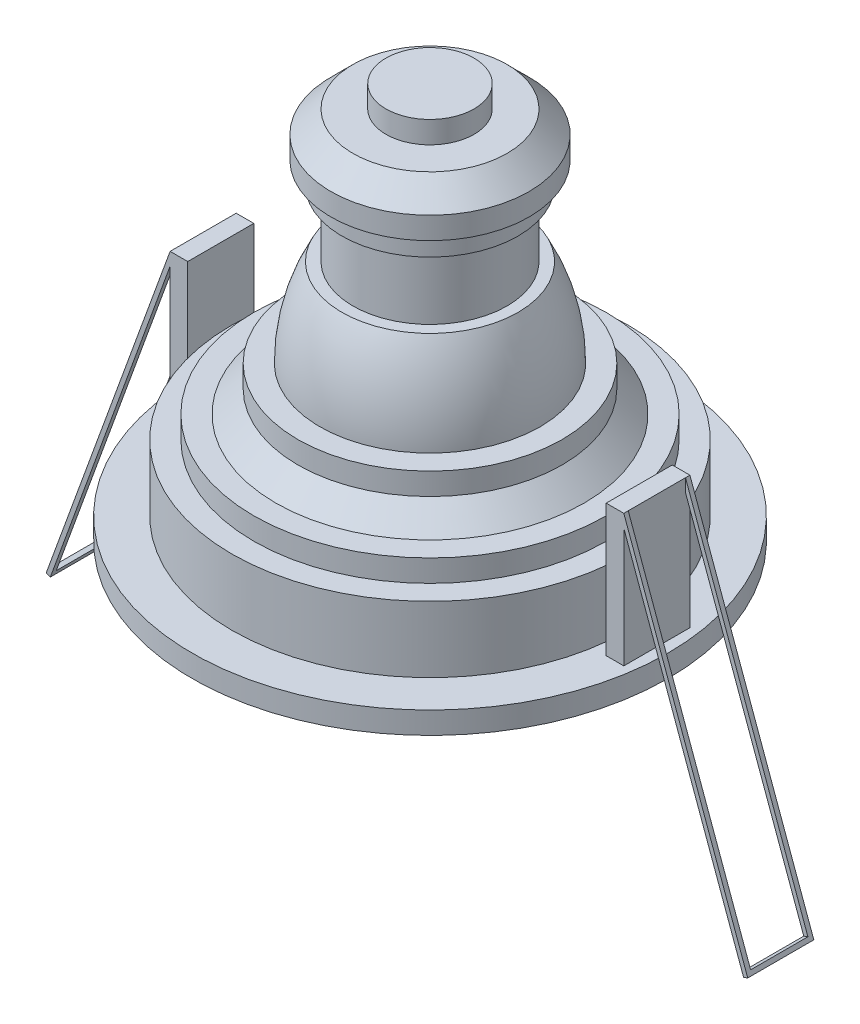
ISO-10303-21;
HEADER;
FILE_DESCRIPTION(('STEP AP214'),'2;1');
FILE_NAME('part.step','',(''),(''),'','','');
FILE_SCHEMA(('AUTOMOTIVE_DESIGN { 1 0 10303 214 1 1 1 1 }'));
ENDSEC;
DATA;
#1=APPLICATION_CONTEXT('core data for automotive mechanical design processes');
#2=APPLICATION_PROTOCOL_DEFINITION('international standard','automotive_design',2000,#1);
#3=PRODUCT_CONTEXT('',#1,'mechanical');
#4=PRODUCT('Part','Part','',(#3));
#5=PRODUCT_RELATED_PRODUCT_CATEGORY('part','',(#4));
#6=PRODUCT_DEFINITION_FORMATION('','',#4);
#7=PRODUCT_DEFINITION_CONTEXT('part definition',#1,'design');
#8=PRODUCT_DEFINITION('design','',#6,#7);
#9=PRODUCT_DEFINITION_SHAPE('','',#8);
#10=(LENGTH_UNIT() NAMED_UNIT(*) SI_UNIT(.MILLI.,.METRE.));
#11=(NAMED_UNIT(*) PLANE_ANGLE_UNIT() SI_UNIT($,.RADIAN.));
#12=(NAMED_UNIT(*) SI_UNIT($,.STERADIAN.) SOLID_ANGLE_UNIT());
#13=UNCERTAINTY_MEASURE_WITH_UNIT(LENGTH_MEASURE(1.E-05),#10,'distance_accuracy_value','');
#14=(GEOMETRIC_REPRESENTATION_CONTEXT(3) GLOBAL_UNCERTAINTY_ASSIGNED_CONTEXT((#13)) GLOBAL_UNIT_ASSIGNED_CONTEXT((#10,
#11,#12)) REPRESENTATION_CONTEXT('',''));
#15=CARTESIAN_POINT('',(0.,0.,0.));
#16=DIRECTION('',(0.,0.,1.));
#17=DIRECTION('',(1.,0.,0.));
#18=AXIS2_PLACEMENT_3D('',#15,#16,#17);
#19=CARTESIAN_POINT('',(51.5,35.,7.5));
#20=DIRECTION('',(1.,0.,0.));
#21=DIRECTION('',(0.,1.,0.));
#22=AXIS2_PLACEMENT_3D('',#19,#20,#21);
#23=PLANE('',#22);
#24=DIRECTION('',(0.,0.,1.));
#25=VECTOR('',#24,1.);
#26=CARTESIAN_POINT('',(51.5,35.,7.5));
#27=LINE('',#26,#25);
#28=CARTESIAN_POINT('',(51.5,35.,-6.5));
#29=VERTEX_POINT('',#28);
#30=CARTESIAN_POINT('',(51.5,35.,6.5));
#31=VERTEX_POINT('',#30);
#32=EDGE_CURVE('E282',#29,#31,#27,.T.);
#33=ORIENTED_EDGE('',*,*,#32,.T.);
#34=DIRECTION('',(0.,-1.,0.));
#35=VECTOR('',#34,1.);
#36=CARTESIAN_POINT('',(51.5,35.,6.5));
#37=LINE('',#36,#35);
#38=CARTESIAN_POINT('',(51.5,32.0761955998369,6.5));
#39=VERTEX_POINT('',#38);
#40=EDGE_CURVE('E59',#31,#39,#37,.T.);
#41=ORIENTED_EDGE('',*,*,#40,.T.);
#42=DIRECTION('',(0.,0.,-1.));
#43=VECTOR('',#42,1.);
#44=CARTESIAN_POINT('',(51.5,32.0761955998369,7.5));
#45=LINE('',#44,#43);
#46=CARTESIAN_POINT('',(51.5,32.0761955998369,7.5));
#47=VERTEX_POINT('',#46);
#48=EDGE_CURVE('E272',#47,#39,#45,.T.);
#49=ORIENTED_EDGE('',*,*,#48,.F.);
#50=DIRECTION('',(0.,-1.,0.));
#51=VECTOR('',#50,1.);
#52=CARTESIAN_POINT('',(51.5,35.,7.5));
#53=LINE('',#52,#51);
#54=CARTESIAN_POINT('',(51.5,5.00000000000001,7.5));
#55=VERTEX_POINT('',#54);
#56=EDGE_CURVE('E311',#47,#55,#53,.T.);
#57=ORIENTED_EDGE('',*,*,#56,.T.);
#58=DIRECTION('',(0.,0.,1.));
#59=VECTOR('',#58,1.);
#60=CARTESIAN_POINT('',(51.5,5.,7.5));
#61=LINE('',#60,#59);
#62=CARTESIAN_POINT('',(51.5,5.00000000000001,-7.5));
#63=VERTEX_POINT('',#62);
#64=EDGE_CURVE('E298',#63,#55,#61,.T.);
#65=ORIENTED_EDGE('',*,*,#64,.F.);
#66=DIRECTION('',(0.,-1.,0.));
#67=VECTOR('',#66,1.);
#68=CARTESIAN_POINT('',(51.5,35.,-7.5));
#69=LINE('',#68,#67);
#70=CARTESIAN_POINT('',(51.5,32.0761955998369,-7.5));
#71=VERTEX_POINT('',#70);
#72=EDGE_CURVE('E308',#71,#63,#69,.T.);
#73=ORIENTED_EDGE('',*,*,#72,.F.);
#74=CARTESIAN_POINT('',(51.5,32.0761955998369,-6.5));
#75=VERTEX_POINT('',#74);
#76=EDGE_CURVE('E66',#75,#71,#45,.T.);
#77=ORIENTED_EDGE('',*,*,#76,.F.);
#78=DIRECTION('',(0.,1.,0.));
#79=VECTOR('',#78,1.);
#80=CARTESIAN_POINT('',(51.5,35.,-6.5));
#81=LINE('',#80,#79);
#82=EDGE_CURVE('E220',#75,#29,#81,.T.);
#83=ORIENTED_EDGE('',*,*,#82,.T.);
#84=EDGE_LOOP('',(#33,#41,#49,#57,#65,#73,#77,#83));
#85=FACE_BOUND('',#84,.T.);
#86=ADVANCED_FACE('F43',(#85),#23,.T.);
#87=CARTESIAN_POINT('',(0.,5.,0.));
#88=DIRECTION('',(0.,1.,0.));
#89=DIRECTION('',(-1.,0.,0.));
#90=AXIS2_PLACEMENT_3D('',#87,#88,#89);
#91=PLANE('',#90);
#92=DIRECTION('',(0.,0.,-1.));
#93=VECTOR('',#92,1.);
#94=CARTESIAN_POINT('',(47.5,5.,-7.5));
#95=LINE('',#94,#93);
#96=CARTESIAN_POINT('',(47.5,5.00000000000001,7.5));
#97=VERTEX_POINT('',#96);
#98=CARTESIAN_POINT('',(47.5,5.,-7.5));
#99=VERTEX_POINT('',#98);
#100=EDGE_CURVE('E292',#97,#99,#95,.T.);
#101=ORIENTED_EDGE('',*,*,#100,.T.);
#102=DIRECTION('',(1.,0.,0.));
#103=VECTOR('',#102,1.);
#104=CARTESIAN_POINT('',(51.5,5.,-7.5));
#105=LINE('',#104,#103);
#106=EDGE_CURVE('E278',#99,#63,#105,.T.);
#107=ORIENTED_EDGE('',*,*,#106,.T.);
#108=ORIENTED_EDGE('',*,*,#64,.T.);
#109=DIRECTION('',(-1.,0.,0.));
#110=VECTOR('',#109,1.);
#111=CARTESIAN_POINT('',(47.5,5.,7.5));
#112=LINE('',#111,#110);
#113=EDGE_CURVE('E295',#55,#97,#112,.T.);
#114=ORIENTED_EDGE('',*,*,#113,.T.);
#115=EDGE_LOOP('',(#101,#107,#108,#114));
#116=FACE_BOUND('',#115,.T.);
#117=CARTESIAN_POINT('',(0.,5.,0.));
#118=DIRECTION('',(0.,-1.,0.));
#119=DIRECTION('',(1.,0.,0.));
#120=AXIS2_PLACEMENT_3D('',#117,#118,#119);
#121=CIRCLE('',#120,45.);
#122=CARTESIAN_POINT('',(45.,5.00000000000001,0.));
#123=VERTEX_POINT('',#122);
#124=EDGE_CURVE('E443',#123,#123,#121,.T.);
#125=ORIENTED_EDGE('',*,*,#124,.T.);
#126=EDGE_LOOP('',(#125));
#127=FACE_BOUND('',#126,.T.);
#128=CARTESIAN_POINT('',(0.,5.,0.));
#129=DIRECTION('',(0.,-1.,0.));
#130=DIRECTION('',(1.,0.,0.));
#131=AXIS2_PLACEMENT_3D('',#128,#129,#130);
#132=CIRCLE('',#131,54.);
#133=CARTESIAN_POINT('',(54.,5.00000000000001,0.));
#134=VERTEX_POINT('',#133);
#135=EDGE_CURVE('E439',#134,#134,#132,.T.);
#136=ORIENTED_EDGE('',*,*,#135,.F.);
#137=EDGE_LOOP('',(#136));
#138=FACE_BOUND('',#137,.T.);
#139=DIRECTION('',(-1.,0.,0.));
#140=VECTOR('',#139,1.);
#141=CARTESIAN_POINT('',(-51.5,5.,-7.5));
#142=LINE('',#141,#140);
#143=CARTESIAN_POINT('',(-47.5,5.,-7.5));
#144=VERTEX_POINT('',#143);
#145=CARTESIAN_POINT('',(-51.5,5.,-7.5));
#146=VERTEX_POINT('',#145);
#147=EDGE_CURVE('E413',#144,#146,#142,.T.);
#148=ORIENTED_EDGE('',*,*,#147,.F.);
#149=DIRECTION('',(0.,0.,-1.));
#150=VECTOR('',#149,1.);
#151=CARTESIAN_POINT('',(-47.5,5.,-7.5));
#152=LINE('',#151,#150);
#153=CARTESIAN_POINT('',(-47.5,5.,7.5));
#154=VERTEX_POINT('',#153);
#155=EDGE_CURVE('E409',#154,#144,#152,.T.);
#156=ORIENTED_EDGE('',*,*,#155,.F.);
#157=DIRECTION('',(1.,0.,0.));
#158=VECTOR('',#157,1.);
#159=CARTESIAN_POINT('',(-47.5,5.,7.5));
#160=LINE('',#159,#158);
#161=CARTESIAN_POINT('',(-51.5,5.,7.5));
#162=VERTEX_POINT('',#161);
#163=EDGE_CURVE('E396',#162,#154,#160,.T.);
#164=ORIENTED_EDGE('',*,*,#163,.F.);
#165=DIRECTION('',(0.,0.,1.));
#166=VECTOR('',#165,1.);
#167=CARTESIAN_POINT('',(-51.5,5.,7.5));
#168=LINE('',#167,#166);
#169=EDGE_CURVE('E417',#146,#162,#168,.T.);
#170=ORIENTED_EDGE('',*,*,#169,.F.);
#171=EDGE_LOOP('',(#148,#156,#164,#170));
#172=FACE_BOUND('',#171,.T.);
#173=ADVANCED_FACE('F526',(#116,#127,#138,#172),#91,.T.);
#174=CARTESIAN_POINT('',(0.,0.,0.));
#175=DIRECTION('',(0.,-1.,0.));
#176=DIRECTION('',(1.,0.,0.));
#177=AXIS2_PLACEMENT_3D('',#174,#175,#176);
#178=PLANE('',#177);
#179=CARTESIAN_POINT('',(0.,0.,0.));
#180=DIRECTION('',(0.,-1.,0.));
#181=DIRECTION('',(1.,0.,0.));
#182=AXIS2_PLACEMENT_3D('',#179,#180,#181);
#183=CIRCLE('',#182,54.);
#184=CARTESIAN_POINT('',(54.,0.,0.));
#185=VERTEX_POINT('',#184);
#186=EDGE_CURVE('E435',#185,#185,#183,.T.);
#187=ORIENTED_EDGE('',*,*,#186,.T.);
#188=EDGE_LOOP('',(#187));
#189=FACE_BOUND('',#188,.T.);
#190=CARTESIAN_POINT('',(0.,0.,0.));
#191=DIRECTION('',(0.,-1.,0.));
#192=DIRECTION('',(1.,0.,0.));
#193=AXIS2_PLACEMENT_3D('',#190,#191,#192);
#194=CIRCLE('',#193,39.);
#195=CARTESIAN_POINT('',(39.,0.,0.));
#196=VERTEX_POINT('',#195);
#197=EDGE_CURVE('E11',#196,#196,#194,.T.);
#198=ORIENTED_EDGE('',*,*,#197,.F.);
#199=EDGE_LOOP('',(#198));
#200=FACE_BOUND('',#199,.T.);
#201=ADVANCED_FACE('F45',(#189,#200),#178,.T.);
#202=CARTESIAN_POINT('',(0.,19.974985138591,0.));
#203=DIRECTION('',(0.,-1.,0.));
#204=DIRECTION('',(1.,0.,0.));
#205=AXIS2_PLACEMENT_3D('',#202,#203,#204);
#206=TOROIDAL_SURFACE('',#205,39.9999843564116,20.);
#207=CARTESIAN_POINT('',(0.,20.,0.));
#208=DIRECTION('',(0.,-1.,0.));
#209=DIRECTION('',(1.,0.,0.));
#210=AXIS2_PLACEMENT_3D('',#207,#208,#209);
#211=CIRCLE('',#210,20.);
#212=CARTESIAN_POINT('',(20.,20.,0.));
#213=VERTEX_POINT('',#212);
#214=EDGE_CURVE('E52',#213,#213,#211,.T.);
#215=ORIENTED_EDGE('',*,*,#214,.F.);
#216=EDGE_LOOP('',(#215));
#217=FACE_BOUND('',#216,.T.);
#218=ORIENTED_EDGE('',*,*,#197,.T.);
#219=EDGE_LOOP('',(#218));
#220=FACE_BOUND('',#219,.T.);
#221=ADVANCED_FACE('F520',(#217,#220),#206,.T.);
#222=CARTESIAN_POINT('',(0.,20.,0.));
#223=DIRECTION('',(0.,-1.,0.));
#224=DIRECTION('',(1.,0.,0.));
#225=AXIS2_PLACEMENT_3D('',#222,#223,#224);
#226=PLANE('',#225);
#227=ORIENTED_EDGE('',*,*,#214,.T.);
#228=EDGE_LOOP('',(#227));
#229=FACE_BOUND('',#228,.T.);
#230=ADVANCED_FACE('F518',(#229),#226,.T.);
#231=CARTESIAN_POINT('',(0.,90.,0.));
#232=DIRECTION('',(0.,-1.,0.));
#233=DIRECTION('',(1.,0.,0.));
#234=AXIS2_PLACEMENT_3D('',#231,#232,#233);
#235=PLANE('',#234);
#236=CARTESIAN_POINT('',(0.,90.,0.));
#237=DIRECTION('',(0.,-1.,0.));
#238=DIRECTION('',(1.,0.,0.));
#239=AXIS2_PLACEMENT_3D('',#236,#237,#238);
#240=CIRCLE('',#239,10.);
#241=CARTESIAN_POINT('',(10.,90.,0.));
#242=VERTEX_POINT('',#241);
#243=EDGE_CURVE('E511',#242,#242,#240,.T.);
#244=ORIENTED_EDGE('',*,*,#243,.F.);
#245=EDGE_LOOP('',(#244));
#246=FACE_BOUND('',#245,.T.);
#247=ADVANCED_FACE('F664',(#246),#235,.F.);
#248=CARTESIAN_POINT('',(0.,20.,0.));
#249=DIRECTION('',(0.,-1.,0.));
#250=DIRECTION('',(1.,0.,0.));
#251=AXIS2_PLACEMENT_3D('',#248,#249,#250);
#252=CYLINDRICAL_SURFACE('',#251,10.);
#253=CARTESIAN_POINT('',(0.,85.,0.));
#254=DIRECTION('',(0.,-1.,0.));
#255=DIRECTION('',(1.,0.,0.));
#256=AXIS2_PLACEMENT_3D('',#253,#254,#255);
#257=CIRCLE('',#256,10.);
#258=CARTESIAN_POINT('',(10.,85.,0.));
#259=VERTEX_POINT('',#258);
#260=EDGE_CURVE('E507',#259,#259,#257,.T.);
#261=ORIENTED_EDGE('',*,*,#260,.F.);
#262=EDGE_LOOP('',(#261));
#263=FACE_BOUND('',#262,.T.);
#264=ORIENTED_EDGE('',*,*,#243,.T.);
#265=EDGE_LOOP('',(#264));
#266=FACE_BOUND('',#265,.T.);
#267=ADVANCED_FACE('F660',(#263,#266),#252,.T.);
#268=CARTESIAN_POINT('',(0.,85.,0.));
#269=DIRECTION('',(0.,-1.,0.));
#270=DIRECTION('',(1.,0.,0.));
#271=AXIS2_PLACEMENT_3D('',#268,#269,#270);
#272=PLANE('',#271);
#273=CARTESIAN_POINT('',(0.,85.,0.));
#274=DIRECTION('',(0.,-1.,0.));
#275=DIRECTION('',(1.,0.,0.));
#276=AXIS2_PLACEMENT_3D('',#273,#274,#275);
#277=CIRCLE('',#276,17.5);
#278=CARTESIAN_POINT('',(17.5,85.,0.));
#279=VERTEX_POINT('',#278);
#280=EDGE_CURVE('E503',#279,#279,#277,.T.);
#281=ORIENTED_EDGE('',*,*,#280,.F.);
#282=EDGE_LOOP('',(#281));
#283=FACE_BOUND('',#282,.T.);
#284=ORIENTED_EDGE('',*,*,#260,.T.);
#285=EDGE_LOOP('',(#284));
#286=FACE_BOUND('',#285,.T.);
#287=ADVANCED_FACE('F656',(#283,#286),#272,.F.);
#288=CARTESIAN_POINT('',(0.,85.,0.));
#289=DIRECTION('',(0.,-1.,0.));
#290=DIRECTION('',(1.,0.,0.));
#291=AXIS2_PLACEMENT_3D('',#288,#289,#290);
#292=CONICAL_SURFACE('',#291,17.5,0.785398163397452);
#293=CARTESIAN_POINT('',(0.,80.,0.));
#294=DIRECTION('',(0.,-1.,0.));
#295=DIRECTION('',(1.,0.,0.));
#296=AXIS2_PLACEMENT_3D('',#293,#294,#295);
#297=CIRCLE('',#296,22.5);
#298=CARTESIAN_POINT('',(22.5,80.,0.));
#299=VERTEX_POINT('',#298);
#300=EDGE_CURVE('E499',#299,#299,#297,.T.);
#301=ORIENTED_EDGE('',*,*,#300,.F.);
#302=EDGE_LOOP('',(#301));
#303=FACE_BOUND('',#302,.T.);
#304=ORIENTED_EDGE('',*,*,#280,.T.);
#305=EDGE_LOOP('',(#304));
#306=FACE_BOUND('',#305,.T.);
#307=ADVANCED_FACE('F652',(#303,#306),#292,.T.);
#308=CARTESIAN_POINT('',(0.,20.,0.));
#309=DIRECTION('',(0.,-1.,0.));
#310=DIRECTION('',(1.,0.,0.));
#311=AXIS2_PLACEMENT_3D('',#308,#309,#310);
#312=CYLINDRICAL_SURFACE('',#311,22.5);
#313=ORIENTED_EDGE('',*,*,#300,.T.);
#314=EDGE_LOOP('',(#313));
#315=FACE_BOUND('',#314,.T.);
#316=CARTESIAN_POINT('',(0.,75.,0.));
#317=DIRECTION('',(0.,-1.,0.));
#318=DIRECTION('',(1.,0.,0.));
#319=AXIS2_PLACEMENT_3D('',#316,#317,#318);
#320=CIRCLE('',#319,22.5);
#321=CARTESIAN_POINT('',(22.5,75.,0.));
#322=VERTEX_POINT('',#321);
#323=EDGE_CURVE('E495',#322,#322,#320,.T.);
#324=ORIENTED_EDGE('',*,*,#323,.F.);
#325=EDGE_LOOP('',(#324));
#326=FACE_BOUND('',#325,.T.);
#327=ADVANCED_FACE('F648',(#315,#326),#312,.T.);
#328=CARTESIAN_POINT('',(0.,75.,0.));
#329=DIRECTION('',(0.,-1.,0.));
#330=DIRECTION('',(1.,0.,0.));
#331=AXIS2_PLACEMENT_3D('',#328,#329,#330);
#332=PLANE('',#331);
#333=ORIENTED_EDGE('',*,*,#323,.T.);
#334=EDGE_LOOP('',(#333));
#335=FACE_BOUND('',#334,.T.);
#336=CARTESIAN_POINT('',(0.,75.,0.));
#337=DIRECTION('',(0.,-1.,0.));
#338=DIRECTION('',(1.,0.,0.));
#339=AXIS2_PLACEMENT_3D('',#336,#337,#338);
#340=CIRCLE('',#339,20.);
#341=CARTESIAN_POINT('',(20.,75.,0.));
#342=VERTEX_POINT('',#341);
#343=EDGE_CURVE('E491',#342,#342,#340,.T.);
#344=ORIENTED_EDGE('',*,*,#343,.F.);
#345=EDGE_LOOP('',(#344));
#346=FACE_BOUND('',#345,.T.);
#347=ADVANCED_FACE('F644',(#335,#346),#332,.T.);
#348=CARTESIAN_POINT('',(0.,20.,0.));
#349=DIRECTION('',(0.,-1.,0.));
#350=DIRECTION('',(1.,0.,0.));
#351=AXIS2_PLACEMENT_3D('',#348,#349,#350);
#352=CYLINDRICAL_SURFACE('',#351,20.);
#353=ORIENTED_EDGE('',*,*,#343,.T.);
#354=EDGE_LOOP('',(#353));
#355=FACE_BOUND('',#354,.T.);
#356=CARTESIAN_POINT('',(0.,70.,0.));
#357=DIRECTION('',(0.,-1.,0.));
#358=DIRECTION('',(1.,0.,0.));
#359=AXIS2_PLACEMENT_3D('',#356,#357,#358);
#360=CIRCLE('',#359,20.);
#361=CARTESIAN_POINT('',(20.,70.,0.));
#362=VERTEX_POINT('',#361);
#363=EDGE_CURVE('E487',#362,#362,#360,.T.);
#364=ORIENTED_EDGE('',*,*,#363,.F.);
#365=EDGE_LOOP('',(#364));
#366=FACE_BOUND('',#365,.T.);
#367=ADVANCED_FACE('F640',(#355,#366),#352,.T.);
#368=CARTESIAN_POINT('',(0.,70.,0.));
#369=DIRECTION('',(0.,-1.,0.));
#370=DIRECTION('',(1.,0.,0.));
#371=AXIS2_PLACEMENT_3D('',#368,#369,#370);
#372=PLANE('',#371);
#373=ORIENTED_EDGE('',*,*,#363,.T.);
#374=EDGE_LOOP('',(#373));
#375=FACE_BOUND('',#374,.T.);
#376=CARTESIAN_POINT('',(0.,70.,0.));
#377=DIRECTION('',(0.,-1.,0.));
#378=DIRECTION('',(1.,0.,0.));
#379=AXIS2_PLACEMENT_3D('',#376,#377,#378);
#380=CIRCLE('',#379,17.5);
#381=CARTESIAN_POINT('',(17.5,70.,0.));
#382=VERTEX_POINT('',#381);
#383=EDGE_CURVE('E483',#382,#382,#380,.T.);
#384=ORIENTED_EDGE('',*,*,#383,.F.);
#385=EDGE_LOOP('',(#384));
#386=FACE_BOUND('',#385,.T.);
#387=ADVANCED_FACE('F636',(#375,#386),#372,.T.);
#388=CARTESIAN_POINT('',(0.,20.,0.));
#389=DIRECTION('',(0.,-1.,0.));
#390=DIRECTION('',(1.,0.,0.));
#391=AXIS2_PLACEMENT_3D('',#388,#389,#390);
#392=CYLINDRICAL_SURFACE('',#391,17.5);
#393=ORIENTED_EDGE('',*,*,#383,.T.);
#394=EDGE_LOOP('',(#393));
#395=FACE_BOUND('',#394,.T.);
#396=CARTESIAN_POINT('',(0.,55.,0.));
#397=DIRECTION('',(0.,-1.,0.));
#398=DIRECTION('',(1.,0.,0.));
#399=AXIS2_PLACEMENT_3D('',#396,#397,#398);
#400=CIRCLE('',#399,17.5);
#401=CARTESIAN_POINT('',(17.5,55.,0.));
#402=VERTEX_POINT('',#401);
#403=EDGE_CURVE('E479',#402,#402,#400,.T.);
#404=ORIENTED_EDGE('',*,*,#403,.F.);
#405=EDGE_LOOP('',(#404));
#406=FACE_BOUND('',#405,.T.);
#407=ADVANCED_FACE('F632',(#395,#406),#392,.T.);
#408=CARTESIAN_POINT('',(0.,55.,0.));
#409=DIRECTION('',(0.,1.,0.));
#410=DIRECTION('',(-1.,0.,0.));
#411=AXIS2_PLACEMENT_3D('',#408,#409,#410);
#412=PLANE('',#411);
#413=ORIENTED_EDGE('',*,*,#403,.T.);
#414=EDGE_LOOP('',(#413));
#415=FACE_BOUND('',#414,.T.);
#416=CARTESIAN_POINT('',(0.,55.,0.));
#417=DIRECTION('',(0.,-1.,0.));
#418=DIRECTION('',(1.,0.,0.));
#419=AXIS2_PLACEMENT_3D('',#416,#417,#418);
#420=CIRCLE('',#419,20.);
#421=CARTESIAN_POINT('',(20.,55.,0.));
#422=VERTEX_POINT('',#421);
#423=EDGE_CURVE('E475',#422,#422,#420,.T.);
#424=ORIENTED_EDGE('',*,*,#423,.F.);
#425=EDGE_LOOP('',(#424));
#426=FACE_BOUND('',#425,.T.);
#427=ADVANCED_FACE('F628',(#415,#426),#412,.T.);
#428=CARTESIAN_POINT('',(0.,35.,0.));
#429=DIRECTION('',(0.,-1.,0.));
#430=DIRECTION('',(1.,0.,0.));
#431=AXIS2_PLACEMENT_3D('',#428,#429,#430);
#432=DEGENERATE_TOROIDAL_SURFACE('',#431,17.5000000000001,42.5000000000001,.F.);
#433=CARTESIAN_POINT('',(0.,35.,0.));
#434=DIRECTION('',(0.,-1.,0.));
#435=DIRECTION('',(1.,0.,0.));
#436=AXIS2_PLACEMENT_3D('',#433,#434,#435);
#437=CIRCLE('',#436,25.);
#438=CARTESIAN_POINT('',(25.,35.,0.));
#439=VERTEX_POINT('',#438);
#440=EDGE_CURVE('E471',#439,#439,#437,.T.);
#441=ORIENTED_EDGE('',*,*,#440,.F.);
#442=EDGE_LOOP('',(#441));
#443=FACE_BOUND('',#442,.T.);
#444=ORIENTED_EDGE('',*,*,#423,.T.);
#445=EDGE_LOOP('',(#444));
#446=FACE_BOUND('',#445,.T.);
#447=ADVANCED_FACE('F624',(#443,#446),#432,.F.);
#448=CARTESIAN_POINT('',(0.,35.,0.));
#449=DIRECTION('',(0.,1.,0.));
#450=DIRECTION('',(-1.,0.,0.));
#451=AXIS2_PLACEMENT_3D('',#448,#449,#450);
#452=PLANE('',#451);
#453=ORIENTED_EDGE('',*,*,#440,.T.);
#454=EDGE_LOOP('',(#453));
#455=FACE_BOUND('',#454,.T.);
#456=CARTESIAN_POINT('',(0.,35.,0.));
#457=DIRECTION('',(0.,-1.,0.));
#458=DIRECTION('',(1.,0.,0.));
#459=AXIS2_PLACEMENT_3D('',#456,#457,#458);
#460=CIRCLE('',#459,30.);
#461=CARTESIAN_POINT('',(30.,35.,0.));
#462=VERTEX_POINT('',#461);
#463=EDGE_CURVE('E467',#462,#462,#460,.T.);
#464=ORIENTED_EDGE('',*,*,#463,.F.);
#465=EDGE_LOOP('',(#464));
#466=FACE_BOUND('',#465,.T.);
#467=ADVANCED_FACE('F620',(#455,#466),#452,.T.);
#468=CARTESIAN_POINT('',(0.,20.,0.));
#469=DIRECTION('',(0.,-1.,0.));
#470=DIRECTION('',(1.,0.,0.));
#471=AXIS2_PLACEMENT_3D('',#468,#469,#470);
#472=CYLINDRICAL_SURFACE('',#471,30.);
#473=ORIENTED_EDGE('',*,*,#463,.T.);
#474=EDGE_LOOP('',(#473));
#475=FACE_BOUND('',#474,.T.);
#476=CARTESIAN_POINT('',(0.,30.,0.));
#477=DIRECTION('',(0.,-1.,0.));
#478=DIRECTION('',(1.,0.,0.));
#479=AXIS2_PLACEMENT_3D('',#476,#477,#478);
#480=CIRCLE('',#479,30.);
#481=CARTESIAN_POINT('',(30.,30.,0.));
#482=VERTEX_POINT('',#481);
#483=EDGE_CURVE('E463',#482,#482,#480,.T.);
#484=ORIENTED_EDGE('',*,*,#483,.F.);
#485=EDGE_LOOP('',(#484));
#486=FACE_BOUND('',#485,.T.);
#487=ADVANCED_FACE('F616',(#475,#486),#472,.T.);
#488=CARTESIAN_POINT('',(0.,30.,0.));
#489=DIRECTION('',(0.,-1.,0.));
#490=DIRECTION('',(1.,0.,0.));
#491=AXIS2_PLACEMENT_3D('',#488,#489,#490);
#492=CONICAL_SURFACE('',#491,30.,0.785398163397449);
#493=CARTESIAN_POINT('',(0.,25.,0.));
#494=DIRECTION('',(0.,-1.,0.));
#495=DIRECTION('',(1.,0.,0.));
#496=AXIS2_PLACEMENT_3D('',#493,#494,#495);
#497=CIRCLE('',#496,35.);
#498=CARTESIAN_POINT('',(35.,25.,0.));
#499=VERTEX_POINT('',#498);
#500=EDGE_CURVE('E459',#499,#499,#497,.T.);
#501=ORIENTED_EDGE('',*,*,#500,.F.);
#502=EDGE_LOOP('',(#501));
#503=FACE_BOUND('',#502,.T.);
#504=ORIENTED_EDGE('',*,*,#483,.T.);
#505=EDGE_LOOP('',(#504));
#506=FACE_BOUND('',#505,.T.);
#507=ADVANCED_FACE('F612',(#503,#506),#492,.T.);
#508=CARTESIAN_POINT('',(0.,25.,0.));
#509=DIRECTION('',(0.,1.,0.));
#510=DIRECTION('',(-1.,0.,0.));
#511=AXIS2_PLACEMENT_3D('',#508,#509,#510);
#512=PLANE('',#511);
#513=ORIENTED_EDGE('',*,*,#500,.T.);
#514=EDGE_LOOP('',(#513));
#515=FACE_BOUND('',#514,.T.);
#516=CARTESIAN_POINT('',(0.,25.,0.));
#517=DIRECTION('',(0.,-1.,0.));
#518=DIRECTION('',(1.,0.,0.));
#519=AXIS2_PLACEMENT_3D('',#516,#517,#518);
#520=CIRCLE('',#519,40.);
#521=CARTESIAN_POINT('',(40.,25.,0.));
#522=VERTEX_POINT('',#521);
#523=EDGE_CURVE('E455',#522,#522,#520,.T.);
#524=ORIENTED_EDGE('',*,*,#523,.F.);
#525=EDGE_LOOP('',(#524));
#526=FACE_BOUND('',#525,.T.);
#527=ADVANCED_FACE('F608',(#515,#526),#512,.T.);
#528=CARTESIAN_POINT('',(0.,20.,0.));
#529=DIRECTION('',(0.,-1.,0.));
#530=DIRECTION('',(1.,0.,0.));
#531=AXIS2_PLACEMENT_3D('',#528,#529,#530);
#532=CYLINDRICAL_SURFACE('',#531,40.);
#533=ORIENTED_EDGE('',*,*,#523,.T.);
#534=EDGE_LOOP('',(#533));
#535=FACE_BOUND('',#534,.T.);
#536=CARTESIAN_POINT('',(0.,20.,0.));
#537=DIRECTION('',(0.,-1.,0.));
#538=DIRECTION('',(1.,0.,0.));
#539=AXIS2_PLACEMENT_3D('',#536,#537,#538);
#540=CIRCLE('',#539,40.);
#541=CARTESIAN_POINT('',(40.,20.,0.));
#542=VERTEX_POINT('',#541);
#543=EDGE_CURVE('E451',#542,#542,#540,.T.);
#544=ORIENTED_EDGE('',*,*,#543,.F.);
#545=EDGE_LOOP('',(#544));
#546=FACE_BOUND('',#545,.T.);
#547=ADVANCED_FACE('F604',(#535,#546),#532,.T.);
#548=CARTESIAN_POINT('',(0.,20.,0.));
#549=DIRECTION('',(0.,1.,0.));
#550=DIRECTION('',(-1.,0.,0.));
#551=AXIS2_PLACEMENT_3D('',#548,#549,#550);
#552=PLANE('',#551);
#553=ORIENTED_EDGE('',*,*,#543,.T.);
#554=EDGE_LOOP('',(#553));
#555=FACE_BOUND('',#554,.T.);
#556=CARTESIAN_POINT('',(0.,20.,0.));
#557=DIRECTION('',(0.,-1.,0.));
#558=DIRECTION('',(1.,0.,0.));
#559=AXIS2_PLACEMENT_3D('',#556,#557,#558);
#560=CIRCLE('',#559,45.);
#561=CARTESIAN_POINT('',(45.,20.,0.));
#562=VERTEX_POINT('',#561);
#563=EDGE_CURVE('E447',#562,#562,#560,.T.);
#564=ORIENTED_EDGE('',*,*,#563,.F.);
#565=EDGE_LOOP('',(#564));
#566=FACE_BOUND('',#565,.T.);
#567=ADVANCED_FACE('F600',(#555,#566),#552,.T.);
#568=CARTESIAN_POINT('',(0.,20.,0.));
#569=DIRECTION('',(0.,-1.,0.));
#570=DIRECTION('',(1.,0.,0.));
#571=AXIS2_PLACEMENT_3D('',#568,#569,#570);
#572=CYLINDRICAL_SURFACE('',#571,45.);
#573=ORIENTED_EDGE('',*,*,#563,.T.);
#574=EDGE_LOOP('',(#573));
#575=FACE_BOUND('',#574,.T.);
#576=ORIENTED_EDGE('',*,*,#124,.F.);
#577=EDGE_LOOP('',(#576));
#578=FACE_BOUND('',#577,.T.);
#579=ADVANCED_FACE('F595',(#575,#578),#572,.T.);
#580=CARTESIAN_POINT('',(0.,20.,0.));
#581=DIRECTION('',(0.,-1.,0.));
#582=DIRECTION('',(1.,0.,0.));
#583=AXIS2_PLACEMENT_3D('',#580,#581,#582);
#584=CYLINDRICAL_SURFACE('',#583,54.);
#585=ORIENTED_EDGE('',*,*,#135,.T.);
#586=EDGE_LOOP('',(#585));
#587=FACE_BOUND('',#586,.T.);
#588=ORIENTED_EDGE('',*,*,#186,.F.);
#589=EDGE_LOOP('',(#588));
#590=FACE_BOUND('',#589,.T.);
#591=ADVANCED_FACE('F592',(#587,#590),#584,.T.);
#592=CARTESIAN_POINT('',(-47.5,35.,-7.5));
#593=DIRECTION('',(-1.,0.,0.));
#594=DIRECTION('',(0.,-1.,0.));
#595=AXIS2_PLACEMENT_3D('',#592,#593,#594);
#596=PLANE('',#595);
#597=ORIENTED_EDGE('',*,*,#155,.T.);
#598=DIRECTION('',(0.,-1.,0.));
#599=VECTOR('',#598,1.);
#600=CARTESIAN_POINT('',(-47.5,35.,-7.5));
#601=LINE('',#600,#599);
#602=CARTESIAN_POINT('',(-47.5,35.,-7.5));
#603=VERTEX_POINT('',#602);
#604=EDGE_CURVE('E432',#603,#144,#601,.T.);
#605=ORIENTED_EDGE('',*,*,#604,.F.);
#606=DIRECTION('',(0.,0.,-1.));
#607=VECTOR('',#606,1.);
#608=CARTESIAN_POINT('',(-47.5,35.,-7.5));
#609=LINE('',#608,#607);
#610=CARTESIAN_POINT('',(-47.5,35.,7.5));
#611=VERTEX_POINT('',#610);
#612=EDGE_CURVE('E391',#611,#603,#609,.T.);
#613=ORIENTED_EDGE('',*,*,#612,.F.);
#614=DIRECTION('',(0.,-1.,0.));
#615=VECTOR('',#614,1.);
#616=CARTESIAN_POINT('',(-47.5,35.,7.5));
#617=LINE('',#616,#615);
#618=EDGE_CURVE('E408',#611,#154,#617,.T.);
#619=ORIENTED_EDGE('',*,*,#618,.T.);
#620=EDGE_LOOP('',(#597,#605,#613,#619));
#621=FACE_BOUND('',#620,.T.);
#622=ADVANCED_FACE('F588',(#621),#596,.F.);
#623=CARTESIAN_POINT('',(-51.5,35.,-7.5));
#624=DIRECTION('',(0.,0.,1.));
#625=DIRECTION('',(1.,0.,0.));
#626=AXIS2_PLACEMENT_3D('',#623,#624,#625);
#627=PLANE('',#626);
#628=DIRECTION('',(-0.342020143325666,-0.939692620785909,0.));
#629=VECTOR('',#628,1.);
#630=CARTESIAN_POINT('',(-51.5,35.,-7.5));
#631=LINE('',#630,#629);
#632=CARTESIAN_POINT('',(-51.5,35.,-7.5));
#633=VERTEX_POINT('',#632);
#634=CARTESIAN_POINT('',(-79.6328387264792,-42.294339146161,-7.5));
#635=VERTEX_POINT('',#634);
#636=EDGE_CURVE('E318',#633,#635,#631,.T.);
#637=ORIENTED_EDGE('',*,*,#636,.F.);
#638=DIRECTION('',(-1.,0.,0.));
#639=VECTOR('',#638,1.);
#640=CARTESIAN_POINT('',(-51.5,35.,-7.5));
#641=LINE('',#640,#639);
#642=EDGE_CURVE('E395',#603,#633,#641,.T.);
#643=ORIENTED_EDGE('',*,*,#642,.F.);
#644=ORIENTED_EDGE('',*,*,#604,.T.);
#645=ORIENTED_EDGE('',*,*,#147,.T.);
#646=DIRECTION('',(0.,-1.,0.));
#647=VECTOR('',#646,1.);
#648=CARTESIAN_POINT('',(-51.5,35.,-7.5));
#649=LINE('',#648,#647);
#650=CARTESIAN_POINT('',(-51.5,32.0761955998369,-7.5));
#651=VERTEX_POINT('',#650);
#652=EDGE_CURVE('E429',#651,#146,#649,.T.);
#653=ORIENTED_EDGE('',*,*,#652,.F.);
#654=DIRECTION('',(-0.342020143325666,-0.939692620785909,0.));
#655=VECTOR('',#654,1.);
#656=CARTESIAN_POINT('',(-50.5603073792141,34.6579798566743,-7.5));
#657=LINE('',#656,#655);
#658=CARTESIAN_POINT('',(-78.6931461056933,-42.6363592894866,-7.5));
#659=VERTEX_POINT('',#658);
#660=EDGE_CURVE('E319',#651,#659,#657,.T.);
#661=ORIENTED_EDGE('',*,*,#660,.T.);
#662=DIRECTION('',(-0.939692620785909,0.342020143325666,0.));
#663=VECTOR('',#662,1.);
#664=CARTESIAN_POINT('',(-78.6931461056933,-42.6363592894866,-7.5));
#665=LINE('',#664,#663);
#666=EDGE_CURVE('E342',#659,#635,#665,.T.);
#667=ORIENTED_EDGE('',*,*,#666,.T.);
#668=EDGE_LOOP('',(#637,#643,#644,#645,#653,#661,#667));
#669=FACE_BOUND('',#668,.T.);
#670=ADVANCED_FACE('F584',(#669),#627,.F.);
#671=CARTESIAN_POINT('',(-51.5,35.,7.5));
#672=DIRECTION('',(1.,0.,0.));
#673=DIRECTION('',(0.,1.,0.));
#674=AXIS2_PLACEMENT_3D('',#671,#672,#673);
#675=PLANE('',#674);
#676=DIRECTION('',(0.,0.,-1.));
#677=VECTOR('',#676,1.);
#678=CARTESIAN_POINT('',(-51.5,32.0761955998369,7.5));
#679=LINE('',#678,#677);
#680=CARTESIAN_POINT('',(-51.5,32.0761955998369,7.5));
#681=VERTEX_POINT('',#680);
#682=CARTESIAN_POINT('',(-51.5,32.0761955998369,6.5));
#683=VERTEX_POINT('',#682);
#684=EDGE_CURVE('E390',#681,#683,#679,.T.);
#685=ORIENTED_EDGE('',*,*,#684,.T.);
#686=DIRECTION('',(0.,1.,0.));
#687=VECTOR('',#686,1.);
#688=CARTESIAN_POINT('',(-51.5,35.,6.5));
#689=LINE('',#688,#687);
#690=CARTESIAN_POINT('',(-51.5,35.,6.5));
#691=VERTEX_POINT('',#690);
#692=EDGE_CURVE('E370',#683,#691,#689,.T.);
#693=ORIENTED_EDGE('',*,*,#692,.T.);
#694=DIRECTION('',(0.,0.,1.));
#695=VECTOR('',#694,1.);
#696=CARTESIAN_POINT('',(-51.5,35.,7.5));
#697=LINE('',#696,#695);
#698=CARTESIAN_POINT('',(-51.5,35.,-6.5));
#699=VERTEX_POINT('',#698);
#700=EDGE_CURVE('E400',#699,#691,#697,.T.);
#701=ORIENTED_EDGE('',*,*,#700,.F.);
#702=DIRECTION('',(0.,-1.,0.));
#703=VECTOR('',#702,1.);
#704=CARTESIAN_POINT('',(-51.5,35.,-6.5));
#705=LINE('',#704,#703);
#706=CARTESIAN_POINT('',(-51.5,32.0761955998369,-6.5));
#707=VERTEX_POINT('',#706);
#708=EDGE_CURVE('E382',#699,#707,#705,.T.);
#709=ORIENTED_EDGE('',*,*,#708,.T.);
#710=EDGE_CURVE('E386',#707,#651,#679,.T.);
#711=ORIENTED_EDGE('',*,*,#710,.T.);
#712=ORIENTED_EDGE('',*,*,#652,.T.);
#713=ORIENTED_EDGE('',*,*,#169,.T.);
#714=DIRECTION('',(0.,-1.,0.));
#715=VECTOR('',#714,1.);
#716=CARTESIAN_POINT('',(-51.5,35.,7.5));
#717=LINE('',#716,#715);
#718=EDGE_CURVE('E426',#681,#162,#717,.T.);
#719=ORIENTED_EDGE('',*,*,#718,.F.);
#720=EDGE_LOOP('',(#685,#693,#701,#709,#711,#712,#713,#719));
#721=FACE_BOUND('',#720,.T.);
#722=ADVANCED_FACE('F580',(#721),#675,.F.);
#723=CARTESIAN_POINT('',(-47.5,35.,7.5));
#724=DIRECTION('',(0.,0.,-1.));
#725=DIRECTION('',(-1.,0.,0.));
#726=AXIS2_PLACEMENT_3D('',#723,#724,#725);
#727=PLANE('',#726);
#728=DIRECTION('',(1.,0.,0.));
#729=VECTOR('',#728,1.);
#730=CARTESIAN_POINT('',(-47.5,35.,7.5));
#731=LINE('',#730,#729);
#732=CARTESIAN_POINT('',(-51.5,35.,7.5));
#733=VERTEX_POINT('',#732);
#734=EDGE_CURVE('E405',#733,#611,#731,.T.);
#735=ORIENTED_EDGE('',*,*,#734,.F.);
#736=DIRECTION('',(0.342020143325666,0.939692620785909,0.));
#737=VECTOR('',#736,1.);
#738=CARTESIAN_POINT('',(-51.5,35.,7.5));
#739=LINE('',#738,#737);
#740=CARTESIAN_POINT('',(-79.6328387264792,-42.294339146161,7.5));
#741=VERTEX_POINT('',#740);
#742=EDGE_CURVE('E350',#741,#733,#739,.T.);
#743=ORIENTED_EDGE('',*,*,#742,.F.);
#744=DIRECTION('',(-0.939692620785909,0.342020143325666,0.));
#745=VECTOR('',#744,1.);
#746=CARTESIAN_POINT('',(-78.6931461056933,-42.6363592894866,7.5));
#747=LINE('',#746,#745);
#748=CARTESIAN_POINT('',(-78.6931461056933,-42.6363592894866,7.5));
#749=VERTEX_POINT('',#748);
#750=EDGE_CURVE('E374',#749,#741,#747,.T.);
#751=ORIENTED_EDGE('',*,*,#750,.F.);
#752=DIRECTION('',(0.342020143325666,0.939692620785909,0.));
#753=VECTOR('',#752,1.);
#754=CARTESIAN_POINT('',(-50.5603073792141,34.6579798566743,7.5));
#755=LINE('',#754,#753);
#756=EDGE_CURVE('E327',#749,#681,#755,.T.);
#757=ORIENTED_EDGE('',*,*,#756,.T.);
#758=ORIENTED_EDGE('',*,*,#718,.T.);
#759=ORIENTED_EDGE('',*,*,#163,.T.);
#760=ORIENTED_EDGE('',*,*,#618,.F.);
#761=EDGE_LOOP('',(#735,#743,#751,#757,#758,#759,#760));
#762=FACE_BOUND('',#761,.T.);
#763=ADVANCED_FACE('F576',(#762),#727,.F.);
#764=CARTESIAN_POINT('',(0.,35.,0.));
#765=DIRECTION('',(0.,-1.,0.));
#766=DIRECTION('',(0.,0.,-1.));
#767=AXIS2_PLACEMENT_3D('',#764,#765,#766);
#768=PLANE('',#767);
#769=ORIENTED_EDGE('',*,*,#612,.T.);
#770=ORIENTED_EDGE('',*,*,#642,.T.);
#771=EDGE_CURVE('E401',#633,#699,#697,.T.);
#772=ORIENTED_EDGE('',*,*,#771,.T.);
#773=ORIENTED_EDGE('',*,*,#700,.T.);
#774=DIRECTION('',(0.,0.,-1.));
#775=VECTOR('',#774,1.);
#776=CARTESIAN_POINT('',(-51.5,35.,6.5));
#777=LINE('',#776,#775);
#778=EDGE_CURVE('E353',#733,#691,#777,.T.);
#779=ORIENTED_EDGE('',*,*,#778,.F.);
#780=ORIENTED_EDGE('',*,*,#734,.T.);
#781=EDGE_LOOP('',(#769,#770,#772,#773,#779,#780));
#782=FACE_BOUND('',#781,.T.);
#783=ADVANCED_FACE('F554',(#782),#768,.F.);
#784=CARTESIAN_POINT('',(-55.7847349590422,20.3039830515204,0.));
#785=DIRECTION('',(0.939692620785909,-0.342020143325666,0.));
#786=DIRECTION('',(0.342020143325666,0.939692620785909,0.));
#787=AXIS2_PLACEMENT_3D('',#784,#785,#786);
#788=PLANE('',#787);
#789=ORIENTED_EDGE('',*,*,#684,.F.);
#790=ORIENTED_EDGE('',*,*,#756,.F.);
#791=DIRECTION('',(0.,0.,1.));
#792=VECTOR('',#791,1.);
#793=CARTESIAN_POINT('',(-78.6931461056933,-42.6363592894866,7.5));
#794=LINE('',#793,#792);
#795=EDGE_CURVE('E322',#659,#749,#794,.T.);
#796=ORIENTED_EDGE('',*,*,#795,.F.);
#797=ORIENTED_EDGE('',*,*,#660,.F.);
#798=ORIENTED_EDGE('',*,*,#710,.F.);
#799=DIRECTION('',(0.342020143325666,0.939692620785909,0.));
#800=VECTOR('',#799,1.);
#801=CARTESIAN_POINT('',(-50.5603073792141,34.6579798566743,-6.5));
#802=LINE('',#801,#800);
#803=CARTESIAN_POINT('',(-78.3511259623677,-41.6966666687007,-6.5));
#804=VERTEX_POINT('',#803);
#805=EDGE_CURVE('E338',#804,#707,#802,.T.);
#806=ORIENTED_EDGE('',*,*,#805,.F.);
#807=DIRECTION('',(0.,0.,-1.));
#808=VECTOR('',#807,1.);
#809=CARTESIAN_POINT('',(-78.3511259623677,-41.6966666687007,6.5));
#810=LINE('',#809,#808);
#811=CARTESIAN_POINT('',(-78.3511259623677,-41.6966666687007,6.5));
#812=VERTEX_POINT('',#811);
#813=EDGE_CURVE('E334',#812,#804,#810,.T.);
#814=ORIENTED_EDGE('',*,*,#813,.F.);
#815=DIRECTION('',(-0.342020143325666,-0.939692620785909,0.));
#816=VECTOR('',#815,1.);
#817=CARTESIAN_POINT('',(-50.5603073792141,34.6579798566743,6.5));
#818=LINE('',#817,#816);
#819=EDGE_CURVE('E331',#683,#812,#818,.T.);
#820=ORIENTED_EDGE('',*,*,#819,.F.);
#821=EDGE_LOOP('',(#789,#790,#796,#797,#798,#806,#814,#820));
#822=FACE_BOUND('',#821,.T.);
#823=ADVANCED_FACE('F550',(#822),#788,.T.);
#824=CARTESIAN_POINT('',(-50.5603073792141,34.6579798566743,-6.5));
#825=DIRECTION('',(0.,0.,1.));
#826=DIRECTION('',(1.,0.,0.));
#827=AXIS2_PLACEMENT_3D('',#824,#825,#826);
#828=PLANE('',#827);
#829=ORIENTED_EDGE('',*,*,#708,.F.);
#830=DIRECTION('',(0.342020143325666,0.939692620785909,0.));
#831=VECTOR('',#830,1.);
#832=CARTESIAN_POINT('',(-51.5,35.,-6.5));
#833=LINE('',#832,#831);
#834=CARTESIAN_POINT('',(-79.2908185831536,-41.354646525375,-6.5));
#835=VERTEX_POINT('',#834);
#836=EDGE_CURVE('E323',#835,#699,#833,.T.);
#837=ORIENTED_EDGE('',*,*,#836,.F.);
#838=DIRECTION('',(-0.939692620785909,0.342020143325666,0.));
#839=VECTOR('',#838,1.);
#840=CARTESIAN_POINT('',(-78.3511259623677,-41.6966666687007,-6.5));
#841=LINE('',#840,#839);
#842=EDGE_CURVE('E367',#804,#835,#841,.T.);
#843=ORIENTED_EDGE('',*,*,#842,.F.);
#844=ORIENTED_EDGE('',*,*,#805,.T.);
#845=EDGE_LOOP('',(#829,#837,#843,#844));
#846=FACE_BOUND('',#845,.T.);
#847=ADVANCED_FACE('F553',(#846),#828,.T.);
#848=CARTESIAN_POINT('',(-50.5603073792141,34.6579798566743,6.5));
#849=DIRECTION('',(0.,0.,-1.));
#850=DIRECTION('',(-1.,0.,0.));
#851=AXIS2_PLACEMENT_3D('',#848,#849,#850);
#852=PLANE('',#851);
#853=ORIENTED_EDGE('',*,*,#692,.F.);
#854=ORIENTED_EDGE('',*,*,#819,.T.);
#855=DIRECTION('',(-0.939692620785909,0.342020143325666,0.));
#856=VECTOR('',#855,1.);
#857=CARTESIAN_POINT('',(-78.3511259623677,-41.6966666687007,6.5));
#858=LINE('',#857,#856);
#859=CARTESIAN_POINT('',(-79.2908185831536,-41.354646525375,6.5));
#860=VERTEX_POINT('',#859);
#861=EDGE_CURVE('E371',#812,#860,#858,.T.);
#862=ORIENTED_EDGE('',*,*,#861,.T.);
#863=DIRECTION('',(-0.342020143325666,-0.939692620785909,0.));
#864=VECTOR('',#863,1.);
#865=CARTESIAN_POINT('',(-51.5,35.,6.5));
#866=LINE('',#865,#864);
#867=EDGE_CURVE('E357',#691,#860,#866,.T.);
#868=ORIENTED_EDGE('',*,*,#867,.F.);
#869=EDGE_LOOP('',(#853,#854,#862,#868));
#870=FACE_BOUND('',#869,.T.);
#871=ADVANCED_FACE('F562',(#870),#852,.T.);
#872=CARTESIAN_POINT('',(-78.3511259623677,-41.6966666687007,6.5));
#873=DIRECTION('',(0.342020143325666,0.939692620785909,0.));
#874=DIRECTION('',(-0.939692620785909,0.342020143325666,0.));
#875=AXIS2_PLACEMENT_3D('',#872,#873,#874);
#876=PLANE('',#875);
#877=DIRECTION('',(0.,0.,-1.));
#878=VECTOR('',#877,1.);
#879=CARTESIAN_POINT('',(-79.2908185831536,-41.354646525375,6.5));
#880=LINE('',#879,#878);
#881=EDGE_CURVE('E361',#860,#835,#880,.T.);
#882=ORIENTED_EDGE('',*,*,#881,.F.);
#883=ORIENTED_EDGE('',*,*,#861,.F.);
#884=ORIENTED_EDGE('',*,*,#813,.T.);
#885=ORIENTED_EDGE('',*,*,#842,.T.);
#886=EDGE_LOOP('',(#882,#883,#884,#885));
#887=FACE_BOUND('',#886,.T.);
#888=ADVANCED_FACE('F564',(#887),#876,.T.);
#889=CARTESIAN_POINT('',(-78.6931461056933,-42.6363592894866,7.5));
#890=DIRECTION('',(-0.342020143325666,-0.939692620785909,0.));
#891=DIRECTION('',(0.93969262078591,-0.342020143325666,0.));
#892=AXIS2_PLACEMENT_3D('',#889,#890,#891);
#893=PLANE('',#892);
#894=DIRECTION('',(0.,0.,1.));
#895=VECTOR('',#894,1.);
#896=CARTESIAN_POINT('',(-79.6328387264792,-42.294339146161,7.5));
#897=LINE('',#896,#895);
#898=EDGE_CURVE('E346',#635,#741,#897,.T.);
#899=ORIENTED_EDGE('',*,*,#898,.F.);
#900=ORIENTED_EDGE('',*,*,#666,.F.);
#901=ORIENTED_EDGE('',*,*,#795,.T.);
#902=ORIENTED_EDGE('',*,*,#750,.T.);
#903=EDGE_LOOP('',(#899,#900,#901,#902));
#904=FACE_BOUND('',#903,.T.);
#905=ADVANCED_FACE('F558',(#904),#893,.T.);
#906=CARTESIAN_POINT('',(-56.7244275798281,20.6460031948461,0.));
#907=DIRECTION('',(0.939692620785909,-0.342020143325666,0.));
#908=DIRECTION('',(0.342020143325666,0.939692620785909,0.));
#909=AXIS2_PLACEMENT_3D('',#906,#907,#908);
#910=PLANE('',#909);
#911=ORIENTED_EDGE('',*,*,#636,.T.);
#912=ORIENTED_EDGE('',*,*,#898,.T.);
#913=ORIENTED_EDGE('',*,*,#742,.T.);
#914=ORIENTED_EDGE('',*,*,#778,.T.);
#915=ORIENTED_EDGE('',*,*,#867,.T.);
#916=ORIENTED_EDGE('',*,*,#881,.T.);
#917=ORIENTED_EDGE('',*,*,#836,.T.);
#918=ORIENTED_EDGE('',*,*,#771,.F.);
#919=EDGE_LOOP('',(#911,#912,#913,#914,#915,#916,#917,#918));
#920=FACE_BOUND('',#919,.T.);
#921=ADVANCED_FACE('F548',(#920),#910,.F.);
#922=CARTESIAN_POINT('',(47.5,35.,-7.5));
#923=DIRECTION('',(-1.,0.,0.));
#924=DIRECTION('',(0.,-1.,0.));
#925=AXIS2_PLACEMENT_3D('',#922,#923,#924);
#926=PLANE('',#925);
#927=ORIENTED_EDGE('',*,*,#100,.F.);
#928=DIRECTION('',(0.,-1.,0.));
#929=VECTOR('',#928,1.);
#930=CARTESIAN_POINT('',(47.5,35.,7.5));
#931=LINE('',#930,#929);
#932=CARTESIAN_POINT('',(47.5,35.,7.5));
#933=VERTEX_POINT('',#932);
#934=EDGE_CURVE('E314',#933,#97,#931,.T.);
#935=ORIENTED_EDGE('',*,*,#934,.F.);
#936=DIRECTION('',(0.,0.,-1.));
#937=VECTOR('',#936,1.);
#938=CARTESIAN_POINT('',(47.5,35.,-7.5));
#939=LINE('',#938,#937);
#940=CARTESIAN_POINT('',(47.5,35.,-7.5));
#941=VERTEX_POINT('',#940);
#942=EDGE_CURVE('E273',#933,#941,#939,.T.);
#943=ORIENTED_EDGE('',*,*,#942,.T.);
#944=DIRECTION('',(0.,-1.,0.));
#945=VECTOR('',#944,1.);
#946=CARTESIAN_POINT('',(47.5,35.,-7.5));
#947=LINE('',#946,#945);
#948=EDGE_CURVE('E291',#941,#99,#947,.T.);
#949=ORIENTED_EDGE('',*,*,#948,.T.);
#950=EDGE_LOOP('',(#927,#935,#943,#949));
#951=FACE_BOUND('',#950,.T.);
#952=ADVANCED_FACE('F544',(#951),#926,.T.);
#953=CARTESIAN_POINT('',(47.5,35.,7.5));
#954=DIRECTION('',(0.,0.,1.));
#955=DIRECTION('',(1.,0.,0.));
#956=AXIS2_PLACEMENT_3D('',#953,#954,#955);
#957=PLANE('',#956);
#958=DIRECTION('',(-0.342020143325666,0.939692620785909,0.));
#959=VECTOR('',#958,1.);
#960=CARTESIAN_POINT('',(51.5,35.,7.5));
#961=LINE('',#960,#959);
#962=CARTESIAN_POINT('',(79.6328387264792,-42.294339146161,7.5));
#963=VERTEX_POINT('',#962);
#964=CARTESIAN_POINT('',(51.5,35.,7.5));
#965=VERTEX_POINT('',#964);
#966=EDGE_CURVE('E250',#963,#965,#961,.T.);
#967=ORIENTED_EDGE('',*,*,#966,.T.);
#968=DIRECTION('',(-1.,0.,0.));
#969=VECTOR('',#968,1.);
#970=CARTESIAN_POINT('',(47.5,35.,7.5));
#971=LINE('',#970,#969);
#972=EDGE_CURVE('E277',#965,#933,#971,.T.);
#973=ORIENTED_EDGE('',*,*,#972,.T.);
#974=ORIENTED_EDGE('',*,*,#934,.T.);
#975=ORIENTED_EDGE('',*,*,#113,.F.);
#976=ORIENTED_EDGE('',*,*,#56,.F.);
#977=DIRECTION('',(-0.342020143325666,0.939692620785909,0.));
#978=VECTOR('',#977,1.);
#979=CARTESIAN_POINT('',(50.5603073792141,34.6579798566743,7.5));
#980=LINE('',#979,#978);
#981=CARTESIAN_POINT('',(78.6931461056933,-42.6363592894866,7.5));
#982=VERTEX_POINT('',#981);
#983=EDGE_CURVE('E230',#982,#47,#980,.T.);
#984=ORIENTED_EDGE('',*,*,#983,.F.);
#985=DIRECTION('',(0.939692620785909,0.342020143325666,0.));
#986=VECTOR('',#985,1.);
#987=CARTESIAN_POINT('',(78.6931461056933,-42.6363592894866,7.5));
#988=LINE('',#987,#986);
#989=EDGE_CURVE('E260',#982,#963,#988,.T.);
#990=ORIENTED_EDGE('',*,*,#989,.T.);
#991=EDGE_LOOP('',(#967,#973,#974,#975,#976,#984,#990));
#992=FACE_BOUND('',#991,.T.);
#993=ADVANCED_FACE('F541',(#992),#957,.T.);
#994=CARTESIAN_POINT('',(51.5,35.,-7.5));
#995=DIRECTION('',(0.,0.,-1.));
#996=DIRECTION('',(-1.,0.,0.));
#997=AXIS2_PLACEMENT_3D('',#994,#995,#996);
#998=PLANE('',#997);
#999=DIRECTION('',(1.,0.,0.));
#1000=VECTOR('',#999,1.);
#1001=CARTESIAN_POINT('',(51.5,35.,-7.5));
#1002=LINE('',#1001,#1000);
#1003=CARTESIAN_POINT('',(51.5,35.,-7.5));
#1004=VERTEX_POINT('',#1003);
#1005=EDGE_CURVE('E287',#941,#1004,#1002,.T.);
#1006=ORIENTED_EDGE('',*,*,#1005,.T.);
#1007=DIRECTION('',(0.342020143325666,-0.939692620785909,0.));
#1008=VECTOR('',#1007,1.);
#1009=CARTESIAN_POINT('',(51.5,35.,-7.5));
#1010=LINE('',#1009,#1008);
#1011=CARTESIAN_POINT('',(79.6328387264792,-42.294339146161,-7.5));
#1012=VERTEX_POINT('',#1011);
#1013=EDGE_CURVE('E235',#1004,#1012,#1010,.T.);
#1014=ORIENTED_EDGE('',*,*,#1013,.T.);
#1015=DIRECTION('',(0.939692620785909,0.342020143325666,0.));
#1016=VECTOR('',#1015,1.);
#1017=CARTESIAN_POINT('',(78.6931461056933,-42.6363592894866,-7.5));
#1018=LINE('',#1017,#1016);
#1019=CARTESIAN_POINT('',(78.6931461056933,-42.6363592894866,-7.5));
#1020=VERTEX_POINT('',#1019);
#1021=EDGE_CURVE('E256',#1020,#1012,#1018,.T.);
#1022=ORIENTED_EDGE('',*,*,#1021,.F.);
#1023=DIRECTION('',(0.342020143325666,-0.939692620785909,0.));
#1024=VECTOR('',#1023,1.);
#1025=CARTESIAN_POINT('',(50.5603073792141,34.6579798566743,-7.5));
#1026=LINE('',#1025,#1024);
#1027=EDGE_CURVE('E222',#71,#1020,#1026,.T.);
#1028=ORIENTED_EDGE('',*,*,#1027,.F.);
#1029=ORIENTED_EDGE('',*,*,#72,.T.);
#1030=ORIENTED_EDGE('',*,*,#106,.F.);
#1031=ORIENTED_EDGE('',*,*,#948,.F.);
#1032=EDGE_LOOP('',(#1006,#1014,#1022,#1028,#1029,#1030,#1031));
#1033=FACE_BOUND('',#1032,.T.);
#1034=ADVANCED_FACE('F539',(#1033),#998,.T.);
#1035=CARTESIAN_POINT('',(0.,35.,0.));
#1036=DIRECTION('',(0.,-1.,0.));
#1037=DIRECTION('',(0.,0.,-1.));
#1038=AXIS2_PLACEMENT_3D('',#1035,#1036,#1037);
#1039=PLANE('',#1038);
#1040=ORIENTED_EDGE('',*,*,#942,.F.);
#1041=ORIENTED_EDGE('',*,*,#972,.F.);
#1042=DIRECTION('',(0.,0.,-1.));
#1043=VECTOR('',#1042,1.);
#1044=CARTESIAN_POINT('',(51.5,35.,6.5));
#1045=LINE('',#1044,#1043);
#1046=EDGE_CURVE('E247',#965,#31,#1045,.T.);
#1047=ORIENTED_EDGE('',*,*,#1046,.T.);
#1048=ORIENTED_EDGE('',*,*,#32,.F.);
#1049=EDGE_CURVE('E283',#1004,#29,#27,.T.);
#1050=ORIENTED_EDGE('',*,*,#1049,.F.);
#1051=ORIENTED_EDGE('',*,*,#1005,.F.);
#1052=EDGE_LOOP('',(#1040,#1041,#1047,#1048,#1050,#1051));
#1053=FACE_BOUND('',#1052,.T.);
#1054=ADVANCED_FACE('F810',(#1053),#1039,.F.);
#1055=CARTESIAN_POINT('',(78.6931461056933,-42.6363592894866,7.5));
#1056=DIRECTION('',(-0.342020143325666,0.939692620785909,0.));
#1057=DIRECTION('',(-0.93969262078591,-0.342020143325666,0.));
#1058=AXIS2_PLACEMENT_3D('',#1055,#1056,#1057);
#1059=PLANE('',#1058);
#1060=DIRECTION('',(0.,0.,1.));
#1061=VECTOR('',#1060,1.);
#1062=CARTESIAN_POINT('',(79.6328387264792,-42.294339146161,7.5));
#1063=LINE('',#1062,#1061);
#1064=EDGE_CURVE('E225',#1012,#963,#1063,.T.);
#1065=ORIENTED_EDGE('',*,*,#1064,.T.);
#1066=ORIENTED_EDGE('',*,*,#989,.F.);
#1067=DIRECTION('',(0.,0.,1.));
#1068=VECTOR('',#1067,1.);
#1069=CARTESIAN_POINT('',(78.6931461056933,-42.6363592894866,7.5));
#1070=LINE('',#1069,#1068);
#1071=EDGE_CURVE('E217',#1020,#982,#1070,.T.);
#1072=ORIENTED_EDGE('',*,*,#1071,.F.);
#1073=ORIENTED_EDGE('',*,*,#1021,.T.);
#1074=EDGE_LOOP('',(#1065,#1066,#1072,#1073));
#1075=FACE_BOUND('',#1074,.T.);
#1076=ADVANCED_FACE('F817',(#1075),#1059,.F.);
#1077=CARTESIAN_POINT('',(50.5603073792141,34.6579798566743,6.5));
#1078=DIRECTION('',(0.,0.,1.));
#1079=DIRECTION('',(1.,0.,0.));
#1080=AXIS2_PLACEMENT_3D('',#1077,#1078,#1079);
#1081=PLANE('',#1080);
#1082=ORIENTED_EDGE('',*,*,#40,.F.);
#1083=DIRECTION('',(0.342020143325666,-0.939692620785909,0.));
#1084=VECTOR('',#1083,1.);
#1085=CARTESIAN_POINT('',(51.5,35.,6.5));
#1086=LINE('',#1085,#1084);
#1087=CARTESIAN_POINT('',(79.2908185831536,-41.354646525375,6.5));
#1088=VERTEX_POINT('',#1087);
#1089=EDGE_CURVE('E244',#31,#1088,#1086,.T.);
#1090=ORIENTED_EDGE('',*,*,#1089,.T.);
#1091=DIRECTION('',(0.939692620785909,0.342020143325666,0.));
#1092=VECTOR('',#1091,1.);
#1093=CARTESIAN_POINT('',(78.3511259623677,-41.6966666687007,6.5));
#1094=LINE('',#1093,#1092);
#1095=CARTESIAN_POINT('',(78.3511259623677,-41.6966666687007,6.5));
#1096=VERTEX_POINT('',#1095);
#1097=EDGE_CURVE('E216',#1096,#1088,#1094,.T.);
#1098=ORIENTED_EDGE('',*,*,#1097,.F.);
#1099=DIRECTION('',(0.342020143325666,-0.939692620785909,0.));
#1100=VECTOR('',#1099,1.);
#1101=CARTESIAN_POINT('',(50.5603073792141,34.6579798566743,6.5));
#1102=LINE('',#1101,#1100);
#1103=EDGE_CURVE('E201',#39,#1096,#1102,.T.);
#1104=ORIENTED_EDGE('',*,*,#1103,.F.);
#1105=EDGE_LOOP('',(#1082,#1090,#1098,#1104));
#1106=FACE_BOUND('',#1105,.T.);
#1107=ADVANCED_FACE('F824',(#1106),#1081,.F.);
#1108=CARTESIAN_POINT('',(78.3511259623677,-41.6966666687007,6.5));
#1109=DIRECTION('',(0.342020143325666,-0.939692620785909,0.));
#1110=DIRECTION('',(0.939692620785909,0.342020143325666,0.));
#1111=AXIS2_PLACEMENT_3D('',#1108,#1109,#1110);
#1112=PLANE('',#1111);
#1113=DIRECTION('',(0.,0.,-1.));
#1114=VECTOR('',#1113,1.);
#1115=CARTESIAN_POINT('',(79.2908185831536,-41.354646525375,6.5));
#1116=LINE('',#1115,#1114);
#1117=CARTESIAN_POINT('',(79.2908185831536,-41.354646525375,-6.5));
#1118=VERTEX_POINT('',#1117);
#1119=EDGE_CURVE('E211',#1088,#1118,#1116,.T.);
#1120=ORIENTED_EDGE('',*,*,#1119,.T.);
#1121=DIRECTION('',(0.939692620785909,0.342020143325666,0.));
#1122=VECTOR('',#1121,1.);
#1123=CARTESIAN_POINT('',(78.3511259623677,-41.6966666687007,-6.5));
#1124=LINE('',#1123,#1122);
#1125=CARTESIAN_POINT('',(78.3511259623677,-41.6966666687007,-6.5));
#1126=VERTEX_POINT('',#1125);
#1127=EDGE_CURVE('E208',#1126,#1118,#1124,.T.);
#1128=ORIENTED_EDGE('',*,*,#1127,.F.);
#1129=DIRECTION('',(0.,0.,-1.));
#1130=VECTOR('',#1129,1.);
#1131=CARTESIAN_POINT('',(78.3511259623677,-41.6966666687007,6.5));
#1132=LINE('',#1131,#1130);
#1133=EDGE_CURVE('E194',#1096,#1126,#1132,.T.);
#1134=ORIENTED_EDGE('',*,*,#1133,.F.);
#1135=ORIENTED_EDGE('',*,*,#1097,.T.);
#1136=EDGE_LOOP('',(#1120,#1128,#1134,#1135));
#1137=FACE_BOUND('',#1136,.T.);
#1138=ADVANCED_FACE('F209',(#1137),#1112,.F.);
#1139=CARTESIAN_POINT('',(50.5603073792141,34.6579798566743,-6.5));
#1140=DIRECTION('',(0.,0.,-1.));
#1141=DIRECTION('',(-1.,0.,0.));
#1142=AXIS2_PLACEMENT_3D('',#1139,#1140,#1141);
#1143=PLANE('',#1142);
#1144=ORIENTED_EDGE('',*,*,#82,.F.);
#1145=DIRECTION('',(-0.342020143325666,0.939692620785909,0.));
#1146=VECTOR('',#1145,1.);
#1147=CARTESIAN_POINT('',(50.5603073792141,34.6579798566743,-6.5));
#1148=LINE('',#1147,#1146);
#1149=EDGE_CURVE('E199',#1126,#75,#1148,.T.);
#1150=ORIENTED_EDGE('',*,*,#1149,.F.);
#1151=ORIENTED_EDGE('',*,*,#1127,.T.);
#1152=DIRECTION('',(-0.342020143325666,0.939692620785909,0.));
#1153=VECTOR('',#1152,1.);
#1154=CARTESIAN_POINT('',(51.5,35.,-6.5));
#1155=LINE('',#1154,#1153);
#1156=EDGE_CURVE('E239',#1118,#29,#1155,.T.);
#1157=ORIENTED_EDGE('',*,*,#1156,.T.);
#1158=EDGE_LOOP('',(#1144,#1150,#1151,#1157));
#1159=FACE_BOUND('',#1158,.T.);
#1160=ADVANCED_FACE('F219',(#1159),#1143,.F.);
#1161=CARTESIAN_POINT('',(55.7847349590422,20.3039830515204,0.));
#1162=DIRECTION('',(-0.939692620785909,-0.342020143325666,0.));
#1163=DIRECTION('',(-0.342020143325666,0.939692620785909,0.));
#1164=AXIS2_PLACEMENT_3D('',#1161,#1162,#1163);
#1165=PLANE('',#1164);
#1166=ORIENTED_EDGE('',*,*,#983,.T.);
#1167=ORIENTED_EDGE('',*,*,#48,.T.);
#1168=ORIENTED_EDGE('',*,*,#1103,.T.);
#1169=ORIENTED_EDGE('',*,*,#1133,.T.);
#1170=ORIENTED_EDGE('',*,*,#1149,.T.);
#1171=ORIENTED_EDGE('',*,*,#76,.T.);
#1172=ORIENTED_EDGE('',*,*,#1027,.T.);
#1173=ORIENTED_EDGE('',*,*,#1071,.T.);
#1174=EDGE_LOOP('',(#1166,#1167,#1168,#1169,#1170,#1171,#1172,#1173));
#1175=FACE_BOUND('',#1174,.T.);
#1176=ADVANCED_FACE('F197',(#1175),#1165,.T.);
#1177=CARTESIAN_POINT('',(56.7244275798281,20.6460031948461,0.));
#1178=DIRECTION('',(-0.939692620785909,-0.342020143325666,0.));
#1179=DIRECTION('',(-0.342020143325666,0.939692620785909,0.));
#1180=AXIS2_PLACEMENT_3D('',#1177,#1178,#1179);
#1181=PLANE('',#1180);
#1182=ORIENTED_EDGE('',*,*,#1013,.F.);
#1183=ORIENTED_EDGE('',*,*,#1049,.T.);
#1184=ORIENTED_EDGE('',*,*,#1156,.F.);
#1185=ORIENTED_EDGE('',*,*,#1119,.F.);
#1186=ORIENTED_EDGE('',*,*,#1089,.F.);
#1187=ORIENTED_EDGE('',*,*,#1046,.F.);
#1188=ORIENTED_EDGE('',*,*,#966,.F.);
#1189=ORIENTED_EDGE('',*,*,#1064,.F.);
#1190=EDGE_LOOP('',(#1182,#1183,#1184,#1185,#1186,#1187,#1188,#1189));
#1191=FACE_BOUND('',#1190,.T.);
#1192=ADVANCED_FACE('F851',(#1191),#1181,.F.);
#1193=CLOSED_SHELL('',(#86,#173,#201,#221,#230,#247,#267,#287,#307,#327,#347,#367,#387,#407,
#427,#447,#467,#487,#507,#527,#547,#567,#579,#591,#622,#670,#722,#763,#783,#823,#847,#871,#888,
#905,#921,#952,#993,#1034,#1054,#1076,#1107,#1138,#1160,#1176,#1192));
#1194=MANIFOLD_SOLID_BREP('B2',#1193);
#1195=ADVANCED_BREP_SHAPE_REPRESENTATION('',(#18,#1194),#14);
#1196=SHAPE_DEFINITION_REPRESENTATION(#9,#1195);
ENDSEC;
END-ISO-10303-21;
